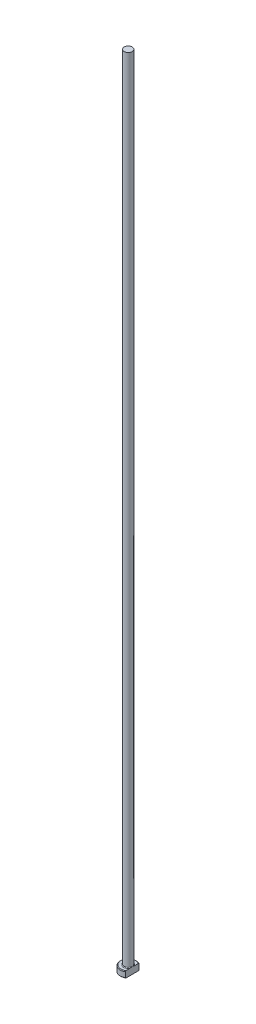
ISO-10303-21;
HEADER;
FILE_DESCRIPTION(('STEP AP214'),'2;1');
FILE_NAME('part.step','',(''),(''),'','','');
FILE_SCHEMA(('AUTOMOTIVE_DESIGN { 1 0 10303 214 1 1 1 1 }'));
ENDSEC;
DATA;
#1=APPLICATION_CONTEXT('core data for automotive mechanical design processes');
#2=APPLICATION_PROTOCOL_DEFINITION('international standard','automotive_design',2000,#1);
#3=PRODUCT_CONTEXT('',#1,'mechanical');
#4=PRODUCT('Part','Part','',(#3));
#5=PRODUCT_RELATED_PRODUCT_CATEGORY('part','',(#4));
#6=PRODUCT_DEFINITION_FORMATION('','',#4);
#7=PRODUCT_DEFINITION_CONTEXT('part definition',#1,'design');
#8=PRODUCT_DEFINITION('design','',#6,#7);
#9=PRODUCT_DEFINITION_SHAPE('','',#8);
#10=(LENGTH_UNIT() NAMED_UNIT(*) SI_UNIT(.MILLI.,.METRE.));
#11=(NAMED_UNIT(*) PLANE_ANGLE_UNIT() SI_UNIT($,.RADIAN.));
#12=(NAMED_UNIT(*) SI_UNIT($,.STERADIAN.) SOLID_ANGLE_UNIT());
#13=UNCERTAINTY_MEASURE_WITH_UNIT(LENGTH_MEASURE(1.E-05),#10,'distance_accuracy_value','');
#14=(GEOMETRIC_REPRESENTATION_CONTEXT(3) GLOBAL_UNCERTAINTY_ASSIGNED_CONTEXT((#13)) GLOBAL_UNIT_ASSIGNED_CONTEXT((#10,
#11,#12)) REPRESENTATION_CONTEXT('',''));
#15=CARTESIAN_POINT('',(0.,0.,0.));
#16=DIRECTION('',(0.,0.,1.));
#17=DIRECTION('',(1.,0.,0.));
#18=AXIS2_PLACEMENT_3D('',#15,#16,#17);
#19=CARTESIAN_POINT('',(0.,0.,0.));
#20=DIRECTION('',(0.,-1.,0.));
#21=DIRECTION('',(0.,0.,-1.));
#22=AXIS2_PLACEMENT_3D('',#19,#20,#21);
#23=PLANE('',#22);
#24=CARTESIAN_POINT('',(0.,0.,0.));
#25=DIRECTION('',(0.,-1.,0.));
#26=DIRECTION('',(0.,0.,-1.));
#27=AXIS2_PLACEMENT_3D('',#24,#25,#26);
#28=CIRCLE('',#27,2.3);
#29=CARTESIAN_POINT('',(1.24999999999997,0.,1.9306734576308));
#30=VERTEX_POINT('',#29);
#31=CARTESIAN_POINT('',(1.24999999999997,0.,-1.9306734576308));
#32=VERTEX_POINT('',#31);
#33=EDGE_CURVE('E98',#30,#32,#28,.T.);
#34=ORIENTED_EDGE('',*,*,#33,.T.);
#35=DIRECTION('',(0.,0.,1.));
#36=VECTOR('',#35,1.);
#37=CARTESIAN_POINT('',(1.24999999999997,0.,-2.16506350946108));
#38=LINE('',#37,#36);
#39=EDGE_CURVE('E83',#32,#30,#38,.T.);
#40=ORIENTED_EDGE('',*,*,#39,.T.);
#41=EDGE_LOOP('',(#34,#40));
#42=FACE_BOUND('',#41,.T.);
#43=ADVANCED_FACE('F32',(#42),#23,.T.);
#44=CARTESIAN_POINT('',(0.,259.958771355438,0.));
#45=DIRECTION('',(0.,1.,0.));
#46=DIRECTION('',(0.,0.,1.));
#47=AXIS2_PLACEMENT_3D('',#44,#45,#46);
#48=CYLINDRICAL_SURFACE('',#47,2.49999999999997);
#49=CARTESIAN_POINT('',(0.,1.79999999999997,0.));
#50=DIRECTION('',(0.,1.,0.));
#51=DIRECTION('',(0.,0.,1.));
#52=AXIS2_PLACEMENT_3D('',#49,#50,#51);
#53=CIRCLE('',#52,2.49999999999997);
#54=CARTESIAN_POINT('',(1.24999999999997,1.79999999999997,2.16506350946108));
#55=VERTEX_POINT('',#54);
#56=CARTESIAN_POINT('',(1.24999999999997,1.79999999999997,-2.16506350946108));
#57=VERTEX_POINT('',#56);
#58=EDGE_CURVE('E104',#55,#57,#53,.F.);
#59=ORIENTED_EDGE('',*,*,#58,.T.);
#60=DIRECTION('',(0.,-1.,0.));
#61=VECTOR('',#60,1.);
#62=CARTESIAN_POINT('',(1.24999999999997,250.,-2.16506350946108));
#63=LINE('',#62,#61);
#64=CARTESIAN_POINT('',(1.24999999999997,0.199999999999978,-2.16506350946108));
#65=VERTEX_POINT('',#64);
#66=EDGE_CURVE('E183',#57,#65,#63,.T.);
#67=ORIENTED_EDGE('',*,*,#66,.T.);
#68=CARTESIAN_POINT('',(0.,0.199999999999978,0.));
#69=DIRECTION('',(0.,-1.,0.));
#70=DIRECTION('',(0.,0.,-1.));
#71=AXIS2_PLACEMENT_3D('',#68,#69,#70);
#72=CIRCLE('',#71,2.49999999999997);
#73=CARTESIAN_POINT('',(1.24999999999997,0.199999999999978,2.16506350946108));
#74=VERTEX_POINT('',#73);
#75=EDGE_CURVE('E100',#65,#74,#72,.F.);
#76=ORIENTED_EDGE('',*,*,#75,.T.);
#77=DIRECTION('',(0.,-1.,0.));
#78=VECTOR('',#77,1.);
#79=CARTESIAN_POINT('',(1.24999999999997,250.,2.16506350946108));
#80=LINE('',#79,#78);
#81=EDGE_CURVE('E93',#55,#74,#80,.T.);
#82=ORIENTED_EDGE('',*,*,#81,.F.);
#83=EDGE_LOOP('',(#59,#67,#76,#82));
#84=FACE_BOUND('',#83,.T.);
#85=ADVANCED_FACE('F158',(#84),#48,.T.);
#86=CARTESIAN_POINT('',(-2.49999999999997,2.,0.));
#87=DIRECTION('',(0.,1.,0.));
#88=DIRECTION('',(0.,0.,1.));
#89=AXIS2_PLACEMENT_3D('',#86,#87,#88);
#90=PLANE('',#89);
#91=CARTESIAN_POINT('',(0.,2.,0.));
#92=DIRECTION('',(0.,1.,0.));
#93=DIRECTION('',(0.,0.,1.));
#94=AXIS2_PLACEMENT_3D('',#91,#92,#93);
#95=CIRCLE('',#94,2.29999999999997);
#96=CARTESIAN_POINT('',(1.24999999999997,2.,-1.93067345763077));
#97=VERTEX_POINT('',#96);
#98=CARTESIAN_POINT('',(1.24999999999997,2.,1.93067345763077));
#99=VERTEX_POINT('',#98);
#100=EDGE_CURVE('E178',#97,#99,#95,.T.);
#101=ORIENTED_EDGE('',*,*,#100,.T.);
#102=DIRECTION('',(0.,0.,-1.));
#103=VECTOR('',#102,1.);
#104=CARTESIAN_POINT('',(1.24999999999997,2.,0.));
#105=LINE('',#104,#103);
#106=CARTESIAN_POINT('',(1.24999999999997,1.99999999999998,0.73484692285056));
#107=VERTEX_POINT('',#106);
#108=EDGE_CURVE('E57',#99,#107,#105,.T.);
#109=ORIENTED_EDGE('',*,*,#108,.T.);
#110=CARTESIAN_POINT('',(0.,2.,0.));
#111=DIRECTION('',(0.,1.,0.));
#112=DIRECTION('',(0.,0.,1.));
#113=AXIS2_PLACEMENT_3D('',#110,#111,#112);
#114=CIRCLE('',#113,1.44999999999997);
#115=CARTESIAN_POINT('',(1.24999999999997,1.99999999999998,-0.734846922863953));
#116=VERTEX_POINT('',#115);
#117=EDGE_CURVE('E107',#107,#116,#114,.F.);
#118=ORIENTED_EDGE('',*,*,#117,.T.);
#119=EDGE_CURVE('E136',#116,#97,#105,.T.);
#120=ORIENTED_EDGE('',*,*,#119,.T.);
#121=EDGE_LOOP('',(#101,#109,#118,#120));
#122=FACE_BOUND('',#121,.T.);
#123=ADVANCED_FACE('F147',(#122),#90,.T.);
#124=CARTESIAN_POINT('',(0.,2.,0.));
#125=DIRECTION('',(0.,-1.,0.));
#126=DIRECTION('',(0.,0.,-1.));
#127=AXIS2_PLACEMENT_3D('',#124,#125,#126);
#128=CONICAL_SURFACE('',#127,2.29999999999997,0.785398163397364);
#129=ORIENTED_EDGE('',*,*,#58,.F.);
#130=CARTESIAN_POINT('',(1.24999999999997,-0.627301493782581,4.76610952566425));
#131=CARTESIAN_POINT('',(1.24999999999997,-0.522786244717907,4.65805337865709));
#132=CARTESIAN_POINT('',(1.24999999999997,-0.418383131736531,4.54988840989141));
#133=CARTESIAN_POINT('',(1.24999999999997,-0.209867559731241,4.33327605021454));
#134=CARTESIAN_POINT('',(1.24999999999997,-0.10575510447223,4.22482865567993));
#135=CARTESIAN_POINT('',(1.24999999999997,0.102163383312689,4.00753373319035));
#136=CARTESIAN_POINT('',(1.24999999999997,0.205969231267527,3.89868602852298));
#137=CARTESIAN_POINT('',(1.24999999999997,0.413121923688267,3.68055575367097));
#138=CARTESIAN_POINT('',(1.24999999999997,0.516468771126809,3.57127318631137));
#139=CARTESIAN_POINT('',(1.24999999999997,0.720522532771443,3.35432408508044));
#140=CARTESIAN_POINT('',(1.24999999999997,0.821241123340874,3.24666854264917));
#141=CARTESIAN_POINT('',(1.24999999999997,1.02192410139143,3.03065701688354));
#142=CARTESIAN_POINT('',(1.24999999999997,1.12188849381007,2.92230103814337));
#143=CARTESIAN_POINT('',(1.24999999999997,1.32077037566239,2.70467415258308));
#144=CARTESIAN_POINT('',(1.24999999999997,1.4196880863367,2.59540344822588));
#145=CARTESIAN_POINT('',(1.24999999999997,1.616082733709,2.37557697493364));
#146=CARTESIAN_POINT('',(1.24999999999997,1.71355972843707,2.26502125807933));
#147=CARTESIAN_POINT('',(1.24999999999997,1.86911393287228,2.08515617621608));
#148=CARTESIAN_POINT('',(1.24999999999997,1.9278559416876,2.01642247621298));
#149=CARTESIAN_POINT('',(1.24999999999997,2.04429378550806,1.87806056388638));
#150=CARTESIAN_POINT('',(1.24999999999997,2.10198951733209,1.80843226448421));
#151=CARTESIAN_POINT('',(1.24999999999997,2.21658041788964,1.66728976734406));
#152=CARTESIAN_POINT('',(1.24999999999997,2.27346067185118,1.59576341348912));
#153=CARTESIAN_POINT('',(1.24999999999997,2.38522965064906,1.45118948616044));
#154=CARTESIAN_POINT('',(1.24999999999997,2.44011885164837,1.37814228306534));
#155=CARTESIAN_POINT('',(1.24999999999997,2.54788773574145,1.22886697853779));
#156=CARTESIAN_POINT('',(1.24999999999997,2.6007242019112,1.15260740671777));
#157=CARTESIAN_POINT('',(1.24999999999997,2.70212030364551,0.997098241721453));
#158=CARTESIAN_POINT('',(1.24999999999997,2.75067405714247,0.917844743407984));
#159=CARTESIAN_POINT('',(1.24999999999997,2.84043729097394,0.756494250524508));
#160=CARTESIAN_POINT('',(1.24999999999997,2.88173033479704,0.674444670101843));
#161=CARTESIAN_POINT('',(1.24999999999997,2.95366083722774,0.505835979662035));
#162=CARTESIAN_POINT('',(1.24999999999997,2.98433405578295,0.41929315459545));
#163=CARTESIAN_POINT('',(1.24999999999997,3.017531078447,0.289507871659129));
#164=CARTESIAN_POINT('',(1.24999999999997,3.02633539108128,0.247870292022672));
#165=CARTESIAN_POINT('',(1.24999999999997,3.03997448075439,0.16393751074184));
#166=CARTESIAN_POINT('',(1.24999999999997,3.04480960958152,0.121642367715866));
#167=CARTESIAN_POINT('',(1.24999999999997,3.05016786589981,0.0369068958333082));
#168=CARTESIAN_POINT('',(1.24999999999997,3.05070431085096,-0.00553257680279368));
#169=CARTESIAN_POINT('',(1.24999999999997,3.04746162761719,-0.0902467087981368));
#170=CARTESIAN_POINT('',(1.24999999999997,3.0436821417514,-0.132521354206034));
#171=CARTESIAN_POINT('',(1.24999999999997,3.03212264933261,-0.216135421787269));
#172=CARTESIAN_POINT('',(1.24999999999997,3.0243775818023,-0.2574797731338));
#173=CARTESIAN_POINT('',(1.24999999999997,3.00536735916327,-0.339354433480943));
#174=CARTESIAN_POINT('',(1.24999999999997,2.9941008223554,-0.37988441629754));
#175=CARTESIAN_POINT('',(1.24999999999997,2.96852211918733,-0.460209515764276));
#176=CARTESIAN_POINT('',(1.24999999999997,2.95419322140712,-0.499999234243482));
#177=CARTESIAN_POINT('',(1.24999999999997,2.92306392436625,-0.578577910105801));
#178=CARTESIAN_POINT('',(1.24999999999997,2.90626403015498,-0.617367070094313));
#179=CARTESIAN_POINT('',(1.24999999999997,2.85269034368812,-0.732719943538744));
#180=CARTESIAN_POINT('',(1.24999999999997,2.81287978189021,-0.807869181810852));
#181=CARTESIAN_POINT('',(1.24999999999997,2.72799210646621,-0.9551579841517));
#182=CARTESIAN_POINT('',(1.24999999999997,2.68290855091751,-1.02729371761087));
#183=CARTESIAN_POINT('',(1.24999999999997,2.58903993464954,-1.16950551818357));
#184=CARTESIAN_POINT('',(1.24999999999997,2.54024093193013,-1.23957230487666));
#185=CARTESIAN_POINT('',(1.24999999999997,2.44021824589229,-1.37788366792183));
#186=CARTESIAN_POINT('',(1.24999999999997,2.38899576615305,-1.44612912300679));
#187=CARTESIAN_POINT('',(1.24999999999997,2.2841109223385,-1.5821527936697));
#188=CARTESIAN_POINT('',(1.24999999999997,2.23042529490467,-1.64991298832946));
#189=CARTESIAN_POINT('',(1.24999999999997,2.1217241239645,-1.78436052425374));
#190=CARTESIAN_POINT('',(1.24999999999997,2.06670849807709,-1.85104779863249));
#191=CARTESIAN_POINT('',(1.24999999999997,1.90044437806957,-2.04954410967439));
#192=CARTESIAN_POINT('',(1.24999999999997,1.78772044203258,-2.18011527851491));
#193=CARTESIAN_POINT('',(1.24999999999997,1.57927088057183,-2.41711311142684));
#194=CARTESIAN_POINT('',(1.24999999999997,1.48391557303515,-2.52386864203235));
#195=CARTESIAN_POINT('',(1.24999999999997,1.29202937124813,-2.73632311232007));
#196=CARTESIAN_POINT('',(1.24999999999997,1.19549844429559,-2.84202202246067));
#197=CARTESIAN_POINT('',(1.24999999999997,0.904469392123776,-3.15815976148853));
#198=CARTESIAN_POINT('',(1.24999999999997,0.708713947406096,-3.36743889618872));
#199=CARTESIAN_POINT('',(1.24999999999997,0.323382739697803,-3.7756119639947));
#200=CARTESIAN_POINT('',(1.24999999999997,0.133884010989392,-3.97457897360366));
#201=CARTESIAN_POINT('',(1.24999999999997,-0.151120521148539,-4.27209258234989));
#202=CARTESIAN_POINT('',(1.24999999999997,-0.246194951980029,-4.37105278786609));
#203=CARTESIAN_POINT('',(1.24999999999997,-0.436581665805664,-4.56874260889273));
#204=CARTESIAN_POINT('',(1.24999999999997,-0.53189394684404,-4.6674722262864));
#205=CARTESIAN_POINT('',(1.24999999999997,-0.627301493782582,-4.76610952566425));
#206=B_SPLINE_CURVE_WITH_KNOTS('',3,(#130,#131,#132,#133,#134,#135,#136,#137,#138,#139,#140,
#141,#142,#143,#144,#145,#146,#147,#148,#149,#150,#151,#152,#153,#154,#155,#156,#157,#158,#159,
#160,#161,#162,#163,#164,#165,#166,#167,#168,#169,#170,#171,#172,#173,#174,#175,#176,#177,#178,
#179,#180,#181,#182,#183,#184,#185,#186,#187,#188,#189,#190,#191,#192,#193,#194,#195,#196,#197,
#198,#199,#200,#201,#202,#203,#204,#205),.UNSPECIFIED.,.F.,.F.,(4,2,2,2,2,2,2,2,2,2,2,2,2,2,2,2,
2,2,2,2,2,2,2,2,2,2,2,2,2,2,2,2,2,2,2,2,2,4),(0.,0.450994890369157,0.901995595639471,
1.35322763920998,1.80445675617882,2.24672733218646,2.68899501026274,3.1311672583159,
3.57332164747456,3.84456018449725,4.11582532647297,4.38995864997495,4.66402597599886,
4.94225842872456,5.2208672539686,5.4960231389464,5.77024327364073,5.89775644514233,
6.02525831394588,6.15236502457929,6.27948226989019,6.40549833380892,6.53156390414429,
6.65833670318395,6.78508362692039,7.03983854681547,7.29490801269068,7.55098686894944,
7.80693985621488,8.06626716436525,8.32561057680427,8.84304654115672,9.27246240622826,
9.70189024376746,10.5615524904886,11.3858525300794,11.7975442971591,12.2092326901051),.UNSPECIFIED.);
#207=EDGE_CURVE('E135',#55,#99,#206,.T.);
#208=ORIENTED_EDGE('',*,*,#207,.T.);
#209=ORIENTED_EDGE('',*,*,#100,.F.);
#210=EDGE_CURVE('E127',#97,#57,#206,.T.);
#211=ORIENTED_EDGE('',*,*,#210,.T.);
#212=EDGE_LOOP('',(#129,#208,#209,#211));
#213=FACE_BOUND('',#212,.T.);
#214=ADVANCED_FACE('F143',(#213),#128,.T.);
#215=CARTESIAN_POINT('',(0.,0.199999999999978,0.));
#216=DIRECTION('',(0.,1.,0.));
#217=DIRECTION('',(0.,0.,1.));
#218=AXIS2_PLACEMENT_3D('',#215,#216,#217);
#219=CONICAL_SURFACE('',#218,2.49999999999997,0.785398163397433);
#220=ORIENTED_EDGE('',*,*,#75,.F.);
#221=CARTESIAN_POINT('',(1.24999999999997,2.62730149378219,-4.76610952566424));
#222=CARTESIAN_POINT('',(1.24999999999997,2.52278624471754,-4.6580533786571));
#223=CARTESIAN_POINT('',(1.24999999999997,2.41838313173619,-4.54988840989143));
#224=CARTESIAN_POINT('',(1.24999999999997,2.20986755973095,-4.33327605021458));
#225=CARTESIAN_POINT('',(1.24999999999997,2.10575510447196,-4.22482865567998));
#226=CARTESIAN_POINT('',(1.24999999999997,1.89783661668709,-4.00753373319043));
#227=CARTESIAN_POINT('',(1.24999999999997,1.79403076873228,-3.89868602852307));
#228=CARTESIAN_POINT('',(1.24999999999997,1.58687807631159,-3.68055575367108));
#229=CARTESIAN_POINT('',(1.24999999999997,1.48353122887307,-3.57127318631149));
#230=CARTESIAN_POINT('',(1.24999999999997,1.27947746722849,-3.35432408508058));
#231=CARTESIAN_POINT('',(1.24999999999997,1.17875887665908,-3.24666854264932));
#232=CARTESIAN_POINT('',(1.24999999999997,0.978075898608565,-3.03065701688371));
#233=CARTESIAN_POINT('',(1.24999999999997,0.87811150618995,-2.92230103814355));
#234=CARTESIAN_POINT('',(1.24999999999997,0.679229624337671,-2.70467415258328));
#235=CARTESIAN_POINT('',(1.24999999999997,0.580311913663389,-2.59540344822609));
#236=CARTESIAN_POINT('',(1.24999999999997,0.383917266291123,-2.37557697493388));
#237=CARTESIAN_POINT('',(1.24999999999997,0.286440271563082,-2.26502125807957));
#238=CARTESIAN_POINT('',(1.24999999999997,0.130886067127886,-2.08515617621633));
#239=CARTESIAN_POINT('',(1.24999999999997,0.0721440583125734,-2.01642247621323));
#240=CARTESIAN_POINT('',(1.24999999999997,-0.0442937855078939,-1.87806056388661));
#241=CARTESIAN_POINT('',(1.24999999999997,-0.101989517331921,-1.80843226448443));
#242=CARTESIAN_POINT('',(1.24999999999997,-0.216580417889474,-1.66728976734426));
#243=CARTESIAN_POINT('',(1.24999999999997,-0.273460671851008,-1.59576341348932));
#244=CARTESIAN_POINT('',(1.24999999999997,-0.38522965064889,-1.45118948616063));
#245=CARTESIAN_POINT('',(1.24999999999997,-0.440118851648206,-1.37814228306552));
#246=CARTESIAN_POINT('',(1.24999999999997,-0.547887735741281,-1.22886697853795));
#247=CARTESIAN_POINT('',(1.24999999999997,-0.600724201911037,-1.15260740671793));
#248=CARTESIAN_POINT('',(1.24999999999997,-0.702120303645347,-0.997098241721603));
#249=CARTESIAN_POINT('',(1.24999999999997,-0.750674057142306,-0.917844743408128));
#250=CARTESIAN_POINT('',(1.24999999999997,-0.840437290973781,-0.756494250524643));
#251=CARTESIAN_POINT('',(1.24999999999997,-0.881730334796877,-0.674444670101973));
#252=CARTESIAN_POINT('',(1.24999999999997,-0.953660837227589,-0.505835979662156));
#253=CARTESIAN_POINT('',(1.24999999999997,-0.984334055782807,-0.419293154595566));
#254=CARTESIAN_POINT('',(1.24999999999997,-1.01753107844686,-0.289507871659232));
#255=CARTESIAN_POINT('',(1.24999999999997,-1.02633539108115,-0.247870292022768));
#256=CARTESIAN_POINT('',(1.24999999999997,-1.03997448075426,-0.163937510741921));
#257=CARTESIAN_POINT('',(1.24999999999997,-1.04480960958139,-0.121642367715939));
#258=CARTESIAN_POINT('',(1.24999999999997,-1.05016786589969,-0.0369068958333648));
#259=CARTESIAN_POINT('',(1.24999999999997,-1.05070431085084,0.0055325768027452));
#260=CARTESIAN_POINT('',(1.24999999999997,-1.04746162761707,0.0902467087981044));
#261=CARTESIAN_POINT('',(1.24999999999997,-1.04368214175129,0.132521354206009));
#262=CARTESIAN_POINT('',(1.24999999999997,-1.03212264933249,0.21613542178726));
#263=CARTESIAN_POINT('',(1.24999999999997,-1.02437758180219,0.2574797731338));
#264=CARTESIAN_POINT('',(1.24999999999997,-1.00536735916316,0.339354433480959));
#265=CARTESIAN_POINT('',(1.24999999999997,-0.994100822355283,0.379884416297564));
#266=CARTESIAN_POINT('',(1.24999999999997,-0.968522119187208,0.460209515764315));
#267=CARTESIAN_POINT('',(1.24999999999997,-0.954193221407,0.499999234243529));
#268=CARTESIAN_POINT('',(1.24999999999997,-0.923063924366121,0.578577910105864));
#269=CARTESIAN_POINT('',(1.24999999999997,-0.906264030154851,0.617367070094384));
#270=CARTESIAN_POINT('',(1.24999999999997,-0.852690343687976,0.732719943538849));
#271=CARTESIAN_POINT('',(1.24999999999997,-0.812879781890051,0.807869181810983));
#272=CARTESIAN_POINT('',(1.24999999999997,-0.727992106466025,0.955157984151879));
#273=CARTESIAN_POINT('',(1.24999999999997,-0.682908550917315,1.02729371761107));
#274=CARTESIAN_POINT('',(1.24999999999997,-0.589039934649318,1.16950551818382));
#275=CARTESIAN_POINT('',(1.24999999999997,-0.540240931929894,1.23957230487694));
#276=CARTESIAN_POINT('',(1.24999999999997,-0.440218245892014,1.37788366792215));
#277=CARTESIAN_POINT('',(1.24999999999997,-0.388995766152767,1.44612912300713));
#278=CARTESIAN_POINT('',(1.24999999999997,-0.284110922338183,1.58215279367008));
#279=CARTESIAN_POINT('',(1.24999999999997,-0.230425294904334,1.64991298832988));
#280=CARTESIAN_POINT('',(1.24999999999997,-0.121724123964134,1.7843605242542));
#281=CARTESIAN_POINT('',(1.24999999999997,-0.0667084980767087,1.85104779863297));
#282=CARTESIAN_POINT('',(1.24999999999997,0.0995556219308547,2.04954410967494));
#283=CARTESIAN_POINT('',(1.24999999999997,0.212279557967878,2.1801152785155));
#284=CARTESIAN_POINT('',(1.24999999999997,0.420729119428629,2.41711311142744));
#285=CARTESIAN_POINT('',(1.24999999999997,0.516084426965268,2.52386864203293));
#286=CARTESIAN_POINT('',(1.24999999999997,0.707970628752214,2.73632311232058));
#287=CARTESIAN_POINT('',(1.24999999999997,0.804501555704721,2.84202202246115));
#288=CARTESIAN_POINT('',(1.24999999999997,1.09553060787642,3.15815976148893));
#289=CARTESIAN_POINT('',(1.24999999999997,1.29128605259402,3.36743889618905));
#290=CARTESIAN_POINT('',(1.24999999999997,1.67661726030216,3.77561196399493));
#291=CARTESIAN_POINT('',(1.24999999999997,1.8661159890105,3.97457897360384));
#292=CARTESIAN_POINT('',(1.24999999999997,2.15112052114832,4.27209258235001));
#293=CARTESIAN_POINT('',(1.24999999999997,2.24619495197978,4.37105278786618));
#294=CARTESIAN_POINT('',(1.24999999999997,2.43658166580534,4.56874260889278));
#295=CARTESIAN_POINT('',(1.24999999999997,2.53189394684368,4.66747222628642));
#296=CARTESIAN_POINT('',(1.24999999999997,2.62730149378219,4.76610952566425));
#297=B_SPLINE_CURVE_WITH_KNOTS('',3,(#221,#222,#223,#224,#225,#226,#227,#228,#229,#230,#231,
#232,#233,#234,#235,#236,#237,#238,#239,#240,#241,#242,#243,#244,#245,#246,#247,#248,#249,#250,
#251,#252,#253,#254,#255,#256,#257,#258,#259,#260,#261,#262,#263,#264,#265,#266,#267,#268,#269,
#270,#271,#272,#273,#274,#275,#276,#277,#278,#279,#280,#281,#282,#283,#284,#285,#286,#287,#288,
#289,#290,#291,#292,#293,#294,#295,#296),.UNSPECIFIED.,.F.,.F.,(4,2,2,2,2,2,2,2,2,2,2,2,2,2,2,2,
2,2,2,2,2,2,2,2,2,2,2,2,2,2,2,2,2,2,2,2,2,4),(0.,0.450994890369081,0.901995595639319,
1.35322763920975,1.80445675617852,2.24672733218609,2.6889950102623,3.1311672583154,
3.57332164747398,3.84456018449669,4.11582532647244,4.38995864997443,4.66402597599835,
4.94225842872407,5.22086725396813,5.49602313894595,5.77024327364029,5.89775644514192,
6.02525831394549,6.15236502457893,6.27948226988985,6.4054983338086,6.531563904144,
6.65833670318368,6.78508362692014,7.03983854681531,7.2949080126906,7.55098686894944,
7.80693985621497,8.06626716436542,8.32561057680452,8.84304654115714,9.27246240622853,
9.70189024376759,10.5615524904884,11.385852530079,11.7975442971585,12.2092326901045),.UNSPECIFIED.);
#298=EDGE_CURVE('E86',#65,#32,#297,.T.);
#299=ORIENTED_EDGE('',*,*,#298,.T.);
#300=ORIENTED_EDGE('',*,*,#33,.F.);
#301=EDGE_CURVE('E89',#30,#74,#297,.T.);
#302=ORIENTED_EDGE('',*,*,#301,.T.);
#303=EDGE_LOOP('',(#220,#299,#300,#302));
#304=FACE_BOUND('',#303,.T.);
#305=ADVANCED_FACE('F97',(#304),#219,.T.);
#306=CARTESIAN_POINT('',(0.,2.19999999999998,0.));
#307=DIRECTION('',(0.,1.,0.));
#308=DIRECTION('',(0.,0.,1.));
#309=AXIS2_PLACEMENT_3D('',#306,#307,#308);
#310=TOROIDAL_SURFACE('',#309,1.44999999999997,0.2);
#311=CARTESIAN_POINT('',(1.24999999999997,2.19999999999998,0.));
#312=CARTESIAN_POINT('',(1.24999999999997,2.20000051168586,-1.9767961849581E-10));
#313=CARTESIAN_POINT('',(1.24999999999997,2.20000102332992,-1.08908063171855E-07));
#314=CARTESIAN_POINT('',(1.24999999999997,2.20000200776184,-4.52594759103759E-07));
#315=CARTESIAN_POINT('',(1.24999999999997,2.20000247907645,-6.90993033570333E-07));
#316=CARTESIAN_POINT('',(1.24999999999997,2.20000341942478,-1.26357942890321E-06));
#317=CARTESIAN_POINT('',(1.24999999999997,2.20000388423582,-1.60457617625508E-06));
#318=CARTESIAN_POINT('',(1.24999999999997,2.20000476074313,-2.3395489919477E-06));
#319=CARTESIAN_POINT('',(1.24999999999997,2.20000517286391,-2.7330414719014E-06));
#320=CARTESIAN_POINT('',(1.24999999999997,2.20000655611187,-4.14544010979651E-06));
#321=CARTESIAN_POINT('',(1.24999999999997,2.20000745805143,-5.23310089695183E-06));
#322=CARTESIAN_POINT('',(1.24999999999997,2.20000906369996,-7.47950358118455E-06));
#323=CARTESIAN_POINT('',(1.24999999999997,2.20000977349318,-8.63414435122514E-06));
#324=CARTESIAN_POINT('',(1.24999999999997,2.20001244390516,-1.31453476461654E-05));
#325=CARTESIAN_POINT('',(1.24999999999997,2.20001426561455,-1.65880555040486E-05));
#326=CARTESIAN_POINT('',(1.24999999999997,2.20001724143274,-2.33729028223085E-05));
#327=CARTESIAN_POINT('',(1.24999999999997,2.20001844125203,-2.66956153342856E-05));
#328=CARTESIAN_POINT('',(1.24999999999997,2.2000235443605,-4.08635084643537E-05));
#329=CARTESIAN_POINT('',(1.24999999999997,2.20002741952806,-5.17114612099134E-05));
#330=CARTESIAN_POINT('',(1.24999999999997,2.20003363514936,-7.20057670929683E-05));
#331=CARTESIAN_POINT('',(1.24999999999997,2.20003612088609,-8.14057063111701E-05));
#332=CARTESIAN_POINT('',(1.24999999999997,2.20005581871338,-0.000149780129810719));
#333=CARTESIAN_POINT('',(1.24999999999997,2.20008094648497,-0.000206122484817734));
#334=CARTESIAN_POINT('',(1.24999999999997,2.20017507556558,-0.000425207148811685));
#335=CARTESIAN_POINT('',(1.24999999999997,2.20023819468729,-0.000589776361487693));
#336=CARTESIAN_POINT('',(1.24999999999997,2.20048692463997,-0.00122878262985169));
#337=CARTESIAN_POINT('',(1.24999999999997,2.20067870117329,-0.00170134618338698));
#338=CARTESIAN_POINT('',(1.24999999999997,2.20146022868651,-0.00363636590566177));
#339=CARTESIAN_POINT('',(1.24999999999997,2.20204298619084,-0.00510090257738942));
#340=CARTESIAN_POINT('',(1.24999999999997,2.20939719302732,-0.0235712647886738));
#341=CARTESIAN_POINT('',(1.24999999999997,2.21621259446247,-0.0405643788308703));
#342=CARTESIAN_POINT('',(1.24999999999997,2.22951000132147,-0.0739606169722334));
#343=CARTESIAN_POINT('',(1.24999999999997,2.23599508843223,-0.0903626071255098));
#344=CARTESIAN_POINT('',(1.24999999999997,2.24961430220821,-0.12511129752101));
#345=CARTESIAN_POINT('',(1.24999999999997,2.25673641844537,-0.143462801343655));
#346=CARTESIAN_POINT('',(1.24999999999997,2.27085039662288,-0.180427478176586));
#347=CARTESIAN_POINT('',(1.24999999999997,2.27784022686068,-0.199041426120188));
#348=CARTESIAN_POINT('',(1.24999999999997,2.29479134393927,-0.245221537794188));
#349=CARTESIAN_POINT('',(1.24999999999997,2.30459026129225,-0.272848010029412));
#350=CARTESIAN_POINT('',(1.24999999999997,2.32310234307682,-0.327738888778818));
#351=CARTESIAN_POINT('',(1.24999999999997,2.33183568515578,-0.354996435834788));
#352=CARTESIAN_POINT('',(1.24999999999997,2.3493656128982,-0.41374417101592));
#353=CARTESIAN_POINT('',(1.24999999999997,2.35799470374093,-0.445285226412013));
#354=CARTESIAN_POINT('',(1.24999999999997,2.37338463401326,-0.509091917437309));
#355=CARTESIAN_POINT('',(1.24999999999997,2.38013036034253,-0.541361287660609));
#356=CARTESIAN_POINT('',(1.24999999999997,2.39136059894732,-0.608339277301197));
#357=CARTESIAN_POINT('',(1.24999999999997,2.39568167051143,-0.643076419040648));
#358=CARTESIAN_POINT('',(1.24999999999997,2.40037605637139,-0.712733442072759));
#359=CARTESIAN_POINT('',(1.24999999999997,2.40076553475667,-0.747651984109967));
#360=CARTESIAN_POINT('',(1.24999999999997,2.39677668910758,-0.8081037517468));
#361=CARTESIAN_POINT('',(1.24999999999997,2.39361441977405,-0.833711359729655));
#362=CARTESIAN_POINT('',(1.24999999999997,2.38355990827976,-0.883915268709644));
#363=CARTESIAN_POINT('',(1.24999999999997,2.37671813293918,-0.908520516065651));
#364=CARTESIAN_POINT('',(1.24999999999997,2.36252570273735,-0.944879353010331));
#365=CARTESIAN_POINT('',(1.24999999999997,2.35688428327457,-0.957298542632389));
#366=CARTESIAN_POINT('',(1.24999999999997,2.34399066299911,-0.981318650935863));
#367=CARTESIAN_POINT('',(1.24999999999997,2.33673636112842,-0.992918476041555));
#368=CARTESIAN_POINT('',(1.24999999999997,2.32199744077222,-1.01267533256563));
#369=CARTESIAN_POINT('',(1.24999999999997,2.31482723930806,-1.02106482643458));
#370=CARTESIAN_POINT('',(1.24999999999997,2.29924321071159,-1.03659690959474));
#371=CARTESIAN_POINT('',(1.24999999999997,2.29083198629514,-1.04374204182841));
#372=CARTESIAN_POINT('',(1.24999999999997,2.27498600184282,-1.05478694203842));
#373=CARTESIAN_POINT('',(1.24999999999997,2.26780814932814,-1.05905359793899));
#374=CARTESIAN_POINT('',(1.24999999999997,2.25284782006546,-1.06635953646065));
#375=CARTESIAN_POINT('',(1.24999999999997,2.24506572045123,-1.06939957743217));
#376=CARTESIAN_POINT('',(1.24999999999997,2.22901828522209,-1.07404931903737));
#377=CARTESIAN_POINT('',(1.24999999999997,2.22074990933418,-1.07564870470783));
#378=CARTESIAN_POINT('',(1.24999999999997,2.20405985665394,-1.07723717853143));
#379=CARTESIAN_POINT('',(1.24999999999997,2.19563825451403,-1.07722703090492));
#380=CARTESIAN_POINT('',(1.24999999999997,2.17988128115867,-1.07569157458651));
#381=CARTESIAN_POINT('',(1.24999999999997,2.17252879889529,-1.0743339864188));
#382=CARTESIAN_POINT('',(1.24999999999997,2.15814333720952,-1.07044616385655));
#383=CARTESIAN_POINT('',(1.24999999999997,2.15111040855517,-1.06791574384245));
#384=CARTESIAN_POINT('',(1.24999999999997,2.13724955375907,-1.06171920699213));
#385=CARTESIAN_POINT('',(1.24999999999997,2.13043935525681,-1.05801386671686));
#386=CARTESIAN_POINT('',(1.24999999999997,2.11740316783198,-1.04969609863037));
#387=CARTESIAN_POINT('',(1.24999999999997,2.11117742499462,-1.04508329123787));
#388=CARTESIAN_POINT('',(1.24999999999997,2.09586196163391,-1.03220341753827));
#389=CARTESIAN_POINT('',(1.24999999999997,2.08723799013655,-1.02338140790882));
#390=CARTESIAN_POINT('',(1.24999999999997,2.07148817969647,-1.00448021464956));
#391=CARTESIAN_POINT('',(1.24999999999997,2.0643671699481,-0.994397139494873));
#392=CARTESIAN_POINT('',(1.24999999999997,2.04800089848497,-0.967694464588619));
#393=CARTESIAN_POINT('',(1.24999999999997,2.0397014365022,-0.950498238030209));
#394=CARTESIAN_POINT('',(1.24999999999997,2.02582422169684,-0.915117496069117));
#395=CARTESIAN_POINT('',(1.24999999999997,2.02024415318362,-0.896933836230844));
#396=CARTESIAN_POINT('',(1.24999999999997,2.00805724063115,-0.846781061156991));
#397=CARTESIAN_POINT('',(1.24999999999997,2.00359525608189,-0.8142976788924));
#398=CARTESIAN_POINT('',(1.24999999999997,1.99933348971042,-0.748574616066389));
#399=CARTESIAN_POINT('',(1.24999999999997,1.99961552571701,-0.715331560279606));
#400=CARTESIAN_POINT('',(1.24999999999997,2.00446632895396,-0.637920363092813));
#401=CARTESIAN_POINT('',(1.24999999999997,2.01044886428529,-0.593849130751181));
#402=CARTESIAN_POINT('',(1.24999999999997,2.02681929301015,-0.506401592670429));
#403=CARTESIAN_POINT('',(1.24999999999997,2.03722697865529,-0.463029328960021));
#404=CARTESIAN_POINT('',(1.24999999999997,2.06007158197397,-0.380638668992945));
#405=CARTESIAN_POINT('',(1.24999999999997,2.07227412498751,-0.34155342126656));
#406=CARTESIAN_POINT('',(1.24999999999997,2.09824323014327,-0.264347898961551));
#407=CARTESIAN_POINT('',(1.24999999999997,2.11199311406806,-0.226221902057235));
#408=CARTESIAN_POINT('',(1.24999999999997,2.13108825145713,-0.175350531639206));
#409=CARTESIAN_POINT('',(1.24999999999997,2.13599999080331,-0.16243890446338));
#410=CARTESIAN_POINT('',(1.24999999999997,2.14604281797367,-0.13631825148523));
#411=CARTESIAN_POINT('',(1.24999999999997,2.15117629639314,-0.123110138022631));
#412=CARTESIAN_POINT('',(1.24999999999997,2.16341702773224,-0.0918425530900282));
#413=CARTESIAN_POINT('',(1.24999999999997,2.17055250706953,-0.0737943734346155));
#414=CARTESIAN_POINT('',(1.24999999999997,2.18426943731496,-0.0393586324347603));
#415=CARTESIAN_POINT('',(1.24999999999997,2.19084281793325,-0.0229681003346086));
#416=CARTESIAN_POINT('',(1.24999999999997,2.19795564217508,-0.00510438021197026));
#417=CARTESIAN_POINT('',(1.24999999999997,2.19853702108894,-0.00364331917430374));
#418=CARTESIAN_POINT('',(1.24999999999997,2.19931818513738,-0.00170914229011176));
#419=CARTESIAN_POINT('',(1.24999999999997,2.19951102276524,-0.00123396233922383));
#420=CARTESIAN_POINT('',(1.24999999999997,2.19976104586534,-0.000591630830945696));
#421=CARTESIAN_POINT('',(1.24999999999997,2.19982443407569,-0.000426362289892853));
#422=CARTESIAN_POINT('',(1.24999999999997,2.1999189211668,-0.000206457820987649));
#423=CARTESIAN_POINT('',(1.24999999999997,2.19994410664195,-0.000149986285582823));
#424=CARTESIAN_POINT('',(1.24999999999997,2.19996383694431,-8.1464748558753E-05));
#425=CARTESIAN_POINT('',(1.24999999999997,2.19996632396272,-7.20551566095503E-05));
#426=CARTESIAN_POINT('',(1.24999999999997,2.19997254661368,-5.17396175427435E-05));
#427=CARTESIAN_POINT('',(1.24999999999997,2.19997642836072,-4.08803462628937E-05));
#428=CARTESIAN_POINT('',(1.24999999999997,2.19998153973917,-2.66997572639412E-05));
#429=CARTESIAN_POINT('',(1.24999999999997,2.1999827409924,-2.33755457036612E-05));
#430=CARTESIAN_POINT('',(1.24999999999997,2.19998572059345,-1.65878757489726E-05));
#431=CARTESIAN_POINT('',(1.24999999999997,2.19998754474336,-1.31438993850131E-05));
#432=CARTESIAN_POINT('',(1.24999999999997,2.19999021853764,-8.63150510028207E-06));
#433=CARTESIAN_POINT('',(1.24999999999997,2.19999092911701,-7.47674879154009E-06));
#434=CARTESIAN_POINT('',(1.24999999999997,2.19999253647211,-5.23027079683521E-06));
#435=CARTESIAN_POINT('',(1.24999999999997,2.19999343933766,-4.14265820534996E-06));
#436=CARTESIAN_POINT('',(1.24999999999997,2.19999482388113,-2.73051190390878E-06));
#437=CARTESIAN_POINT('',(1.24999999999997,2.19999523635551,-2.33712918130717E-06));
#438=CARTESIAN_POINT('',(1.24999999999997,2.19999611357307,-1.60243917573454E-06));
#439=CARTESIAN_POINT('',(1.24999999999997,2.19999657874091,-1.26161620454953E-06));
#440=CARTESIAN_POINT('',(1.24999999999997,2.19999751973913,-6.89449591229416E-07));
#441=CARTESIAN_POINT('',(1.24999999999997,2.19999799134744,-4.51288697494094E-07));
#442=CARTESIAN_POINT('',(1.24999999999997,2.19999897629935,-1.08178109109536E-07));
#443=CARTESIAN_POINT('',(1.24999999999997,2.19999948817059,1.97735059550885E-10));
#444=CARTESIAN_POINT('',(1.24999999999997,2.19999999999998,0.));
#445=B_SPLINE_CURVE_WITH_KNOTS('',3,(#311,#312,#313,#314,#315,#316,#317,#318,#319,#320,#321,
#322,#323,#324,#325,#326,#327,#328,#329,#330,#331,#332,#333,#334,#335,#336,#337,#338,#339,#340,
#341,#342,#343,#344,#345,#346,#347,#348,#349,#350,#351,#352,#353,#354,#355,#356,#357,#358,#359,
#360,#361,#362,#363,#364,#365,#366,#367,#368,#369,#370,#371,#372,#373,#374,#375,#376,#377,#378,
#379,#380,#381,#382,#383,#384,#385,#386,#387,#388,#389,#390,#391,#392,#393,#394,#395,#396,#397,
#398,#399,#400,#401,#402,#403,#404,#405,#406,#407,#408,#409,#410,#411,#412,#413,#414,#415,#416,
#417,#418,#419,#420,#421,#422,#423,#424,#425,#426,#427,#428,#429,#430,#431,#432,#433,#434,#435,
#436,#437,#438,#439,#440,#441,#442,#443,#444),.UNSPECIFIED.,.T.,.F.,(4,2,2,2,2,2,2,2,2,2,2,2,2,
2,2,2,2,2,2,2,2,2,2,2,2,2,2,2,2,2,2,2,2,2,2,2,2,2,2,2,2,2,2,2,2,2,2,2,2,2,2,2,2,2,2,2,2,2,2,2,2,
2,2,2,2,2,4),(0.,1.53427576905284E-06,3.11115061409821E-06,4.83351643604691E-06,
6.54098955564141E-06,1.07594295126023E-05,1.48222852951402E-05,2.64707315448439E-05,
3.70576290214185E-05,7.16088727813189E-05,0.000100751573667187,0.000285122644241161,
0.000814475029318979,0.00234373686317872,0.00707317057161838,0.061994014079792,
0.114907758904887,0.173961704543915,0.233609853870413,0.321537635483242,0.407388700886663,
0.505443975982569,0.604264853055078,0.709126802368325,0.813557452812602,0.890773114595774,
0.966955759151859,1.00778845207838,1.04867465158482,1.08167318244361,1.1146034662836,
1.13955805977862,1.16449720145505,1.18961351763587,1.21471790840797,1.23704542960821,
1.25937648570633,1.28254952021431,1.30573226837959,1.34253218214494,1.37944859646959,
1.43640829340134,1.4933194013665,1.59113685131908,1.69064301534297,1.82371118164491,
1.9573808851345,2.08016146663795,2.20172662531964,2.24316968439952,2.28568093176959,
2.34390494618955,2.39687801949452,2.40159623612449,2.40313396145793,2.40366556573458,
2.40385035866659,2.40387953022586,2.40391411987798,2.40392471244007,2.40393636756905,
2.4039404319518,2.40394465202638,2.40394636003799,2.4039480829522,2.40394966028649,
2.40395119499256),.UNSPECIFIED.);
#446=CARTESIAN_POINT('',(1.24999999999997,2.19999999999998,0.));
#447=VERTEX_POINT('',#446);
#448=EDGE_CURVE('E11',#116,#447,#445,.T.);
#449=ORIENTED_EDGE('',*,*,#448,.F.);
#450=ORIENTED_EDGE('',*,*,#117,.F.);
#451=CARTESIAN_POINT('',(1.24999999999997,2.19999999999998,0.));
#452=CARTESIAN_POINT('',(1.24999999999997,2.1999994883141,1.97679627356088E-10));
#453=CARTESIAN_POINT('',(1.24999999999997,2.19999897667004,1.08908063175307E-07));
#454=CARTESIAN_POINT('',(1.24999999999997,2.19999799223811,4.52594759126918E-07));
#455=CARTESIAN_POINT('',(1.24999999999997,2.19999752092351,6.90993033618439E-07));
#456=CARTESIAN_POINT('',(1.24999999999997,2.19999658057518,1.26357942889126E-06));
#457=CARTESIAN_POINT('',(1.24999999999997,2.19999611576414,1.60457617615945E-06));
#458=CARTESIAN_POINT('',(1.24999999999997,2.19999523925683,2.33954899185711E-06));
#459=CARTESIAN_POINT('',(1.24999999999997,2.19999482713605,2.73304147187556E-06));
#460=CARTESIAN_POINT('',(1.24999999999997,2.19999344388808,4.14544010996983E-06));
#461=CARTESIAN_POINT('',(1.24999999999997,2.19999254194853,5.23310089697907E-06));
#462=CARTESIAN_POINT('',(1.24999999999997,2.1999909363,7.47950358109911E-06));
#463=CARTESIAN_POINT('',(1.24999999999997,2.19999022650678,8.63414435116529E-06));
#464=CARTESIAN_POINT('',(1.24999999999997,2.1999875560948,1.3145347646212E-05));
#465=CARTESIAN_POINT('',(1.24999999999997,2.19998573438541,1.65880555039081E-05));
#466=CARTESIAN_POINT('',(1.24999999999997,2.19998275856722,2.33729028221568E-05));
#467=CARTESIAN_POINT('',(1.24999999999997,2.19998155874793,2.66956153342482E-05));
#468=CARTESIAN_POINT('',(1.24999999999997,2.19997645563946,4.08635084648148E-05));
#469=CARTESIAN_POINT('',(1.24999999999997,2.1999725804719,5.1711461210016E-05));
#470=CARTESIAN_POINT('',(1.24999999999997,2.1999663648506,7.2005767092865E-05));
#471=CARTESIAN_POINT('',(1.24999999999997,2.19996387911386,8.14057063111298E-05));
#472=CARTESIAN_POINT('',(1.24999999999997,2.19994418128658,0.000149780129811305));
#473=CARTESIAN_POINT('',(1.24999999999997,2.19991905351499,0.000206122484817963));
#474=CARTESIAN_POINT('',(1.24999999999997,2.19982492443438,0.000425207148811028));
#475=CARTESIAN_POINT('',(1.24999999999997,2.19976180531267,0.000589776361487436));
#476=CARTESIAN_POINT('',(1.24999999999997,2.19951307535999,0.00122878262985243));
#477=CARTESIAN_POINT('',(1.24999999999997,2.19932129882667,0.00170134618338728));
#478=CARTESIAN_POINT('',(1.24999999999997,2.19853977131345,0.00363636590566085));
#479=CARTESIAN_POINT('',(1.24999999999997,2.19795701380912,0.00510090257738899));
#480=CARTESIAN_POINT('',(1.24999999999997,2.19060280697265,0.0235712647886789));
#481=CARTESIAN_POINT('',(1.24999999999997,2.18378740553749,0.0405643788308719));
#482=CARTESIAN_POINT('',(1.24999999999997,2.17048999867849,0.0739606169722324));
#483=CARTESIAN_POINT('',(1.24999999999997,2.16400491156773,0.0903626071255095));
#484=CARTESIAN_POINT('',(1.24999999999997,2.15038569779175,0.125111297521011));
#485=CARTESIAN_POINT('',(1.24999999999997,2.14326358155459,0.143462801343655));
#486=CARTESIAN_POINT('',(1.24999999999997,2.12914960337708,0.180427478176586));
#487=CARTESIAN_POINT('',(1.24999999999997,2.12215977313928,0.199041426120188));
#488=CARTESIAN_POINT('',(1.24999999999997,2.10520865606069,0.245221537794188));
#489=CARTESIAN_POINT('',(1.24999999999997,2.09540973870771,0.272848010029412));
#490=CARTESIAN_POINT('',(1.24999999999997,2.07689765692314,0.327738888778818));
#491=CARTESIAN_POINT('',(1.24999999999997,2.06816431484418,0.354996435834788));
#492=CARTESIAN_POINT('',(1.24999999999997,2.05063438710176,0.41374417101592));
#493=CARTESIAN_POINT('',(1.24999999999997,2.04200529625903,0.445285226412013));
#494=CARTESIAN_POINT('',(1.24999999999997,2.0266153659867,0.509091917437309));
#495=CARTESIAN_POINT('',(1.24999999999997,2.01986963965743,0.541361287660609));
#496=CARTESIAN_POINT('',(1.24999999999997,2.00863940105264,0.608339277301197));
#497=CARTESIAN_POINT('',(1.24999999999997,2.00431832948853,0.643076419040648));
#498=CARTESIAN_POINT('',(1.24999999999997,1.99962394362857,0.712733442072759));
#499=CARTESIAN_POINT('',(1.24999999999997,1.99923446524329,0.747651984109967));
#500=CARTESIAN_POINT('',(1.24999999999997,2.00322331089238,0.8081037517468));
#501=CARTESIAN_POINT('',(1.24999999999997,2.00638558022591,0.833711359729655));
#502=CARTESIAN_POINT('',(1.24999999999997,2.0164400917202,0.883915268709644));
#503=CARTESIAN_POINT('',(1.24999999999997,2.02328186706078,0.908520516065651));
#504=CARTESIAN_POINT('',(1.24999999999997,2.03747429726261,0.944879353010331));
#505=CARTESIAN_POINT('',(1.24999999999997,2.04311571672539,0.957298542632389));
#506=CARTESIAN_POINT('',(1.24999999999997,2.05600933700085,0.981318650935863));
#507=CARTESIAN_POINT('',(1.24999999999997,2.06326363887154,0.992918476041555));
#508=CARTESIAN_POINT('',(1.24999999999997,2.07800255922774,1.01267533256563));
#509=CARTESIAN_POINT('',(1.24999999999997,2.0851727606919,1.02106482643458));
#510=CARTESIAN_POINT('',(1.24999999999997,2.10075678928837,1.03659690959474));
#511=CARTESIAN_POINT('',(1.24999999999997,2.10916801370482,1.04374204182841));
#512=CARTESIAN_POINT('',(1.24999999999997,2.12501399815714,1.05478694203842));
#513=CARTESIAN_POINT('',(1.24999999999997,2.13219185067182,1.05905359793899));
#514=CARTESIAN_POINT('',(1.24999999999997,2.1471521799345,1.06635953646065));
#515=CARTESIAN_POINT('',(1.24999999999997,2.15493427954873,1.06939957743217));
#516=CARTESIAN_POINT('',(1.24999999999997,2.17098171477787,1.07404931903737));
#517=CARTESIAN_POINT('',(1.24999999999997,2.17925009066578,1.07564870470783));
#518=CARTESIAN_POINT('',(1.24999999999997,2.19594014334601,1.07723717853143));
#519=CARTESIAN_POINT('',(1.24999999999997,2.20436174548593,1.07722703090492));
#520=CARTESIAN_POINT('',(1.24999999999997,2.22011871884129,1.07569157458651));
#521=CARTESIAN_POINT('',(1.24999999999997,2.22747120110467,1.0743339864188));
#522=CARTESIAN_POINT('',(1.24999999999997,2.24185666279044,1.07044616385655));
#523=CARTESIAN_POINT('',(1.24999999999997,2.24888959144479,1.06791574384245));
#524=CARTESIAN_POINT('',(1.24999999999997,2.26275044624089,1.06171920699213));
#525=CARTESIAN_POINT('',(1.24999999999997,2.26956064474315,1.05801386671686));
#526=CARTESIAN_POINT('',(1.24999999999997,2.28259683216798,1.04969609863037));
#527=CARTESIAN_POINT('',(1.24999999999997,2.28882257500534,1.04508329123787));
#528=CARTESIAN_POINT('',(1.24999999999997,2.30413803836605,1.03220341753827));
#529=CARTESIAN_POINT('',(1.24999999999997,2.31276200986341,1.02338140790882));
#530=CARTESIAN_POINT('',(1.24999999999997,2.32851182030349,1.00448021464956));
#531=CARTESIAN_POINT('',(1.24999999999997,2.33563283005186,0.994397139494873));
#532=CARTESIAN_POINT('',(1.24999999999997,2.35199910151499,0.967694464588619));
#533=CARTESIAN_POINT('',(1.24999999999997,2.36029856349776,0.950498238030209));
#534=CARTESIAN_POINT('',(1.24999999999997,2.37417577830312,0.915117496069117));
#535=CARTESIAN_POINT('',(1.24999999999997,2.37975584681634,0.896933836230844));
#536=CARTESIAN_POINT('',(1.24999999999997,2.3919427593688,0.846781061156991));
#537=CARTESIAN_POINT('',(1.24999999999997,2.39640474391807,0.8142976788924));
#538=CARTESIAN_POINT('',(1.24999999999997,2.40066651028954,0.748574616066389));
#539=CARTESIAN_POINT('',(1.24999999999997,2.40038447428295,0.715331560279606));
#540=CARTESIAN_POINT('',(1.24999999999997,2.395533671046,0.637920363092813));
#541=CARTESIAN_POINT('',(1.24999999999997,2.38955113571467,0.593849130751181));
#542=CARTESIAN_POINT('',(1.24999999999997,2.3731807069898,0.506401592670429));
#543=CARTESIAN_POINT('',(1.24999999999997,2.36277302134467,0.463029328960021));
#544=CARTESIAN_POINT('',(1.24999999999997,2.33992841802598,0.380638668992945));
#545=CARTESIAN_POINT('',(1.24999999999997,2.32772587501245,0.34155342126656));
#546=CARTESIAN_POINT('',(1.24999999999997,2.30175676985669,0.264347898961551));
#547=CARTESIAN_POINT('',(1.24999999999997,2.2880068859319,0.226221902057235));
#548=CARTESIAN_POINT('',(1.24999999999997,2.26891174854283,0.175350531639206));
#549=CARTESIAN_POINT('',(1.24999999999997,2.26400000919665,0.162438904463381));
#550=CARTESIAN_POINT('',(1.24999999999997,2.25395718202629,0.13631825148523));
#551=CARTESIAN_POINT('',(1.24999999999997,2.24882370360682,0.123110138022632));
#552=CARTESIAN_POINT('',(1.24999999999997,2.23658297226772,0.091842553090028));
#553=CARTESIAN_POINT('',(1.24999999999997,2.22944749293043,0.0737943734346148));
#554=CARTESIAN_POINT('',(1.24999999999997,2.215730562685,0.0393586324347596));
#555=CARTESIAN_POINT('',(1.24999999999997,2.20915718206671,0.0229681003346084));
#556=CARTESIAN_POINT('',(1.24999999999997,2.20204435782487,0.00510438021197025));
#557=CARTESIAN_POINT('',(1.24999999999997,2.20146297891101,0.00364331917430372));
#558=CARTESIAN_POINT('',(1.24999999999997,2.20068181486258,0.00170914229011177));
#559=CARTESIAN_POINT('',(1.24999999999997,2.20048897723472,0.00123396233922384));
#560=CARTESIAN_POINT('',(1.24999999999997,2.20023895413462,0.000591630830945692));
#561=CARTESIAN_POINT('',(1.24999999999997,2.20017556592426,0.000426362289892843));
#562=CARTESIAN_POINT('',(1.24999999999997,2.20008107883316,0.000206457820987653));
#563=CARTESIAN_POINT('',(1.24999999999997,2.20005589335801,0.000149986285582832));
#564=CARTESIAN_POINT('',(1.24999999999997,2.20003616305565,8.14647485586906E-05));
#565=CARTESIAN_POINT('',(1.24999999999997,2.20003367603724,7.20551566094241E-05));
#566=CARTESIAN_POINT('',(1.24999999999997,2.20002745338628,5.17396175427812E-05));
#567=CARTESIAN_POINT('',(1.24999999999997,2.20002357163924,4.08803462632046E-05));
#568=CARTESIAN_POINT('',(1.24999999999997,2.20001846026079,2.66997572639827E-05));
#569=CARTESIAN_POINT('',(1.24999999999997,2.20001725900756,2.33755457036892E-05));
#570=CARTESIAN_POINT('',(1.24999999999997,2.20001427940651,1.65878757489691E-05));
#571=CARTESIAN_POINT('',(1.24999999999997,2.2000124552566,1.31438993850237E-05));
#572=CARTESIAN_POINT('',(1.24999999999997,2.20000978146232,8.63150510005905E-06));
#573=CARTESIAN_POINT('',(1.24999999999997,2.20000907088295,7.47674879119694E-06));
#574=CARTESIAN_POINT('',(1.24999999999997,2.20000746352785,5.23027079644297E-06));
#575=CARTESIAN_POINT('',(1.24999999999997,2.2000065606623,4.14265820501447E-06));
#576=CARTESIAN_POINT('',(1.24999999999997,2.20000517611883,2.7305119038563E-06));
#577=CARTESIAN_POINT('',(1.24999999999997,2.20000476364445,2.33712918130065E-06));
#578=CARTESIAN_POINT('',(1.24999999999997,2.20000388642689,1.60243917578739E-06));
#579=CARTESIAN_POINT('',(1.24999999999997,2.20000342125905,1.26161620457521E-06));
#580=CARTESIAN_POINT('',(1.24999999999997,2.20000248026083,6.89449591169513E-07));
#581=CARTESIAN_POINT('',(1.24999999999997,2.20000200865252,4.51288697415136E-07));
#582=CARTESIAN_POINT('',(1.24999999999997,2.20000102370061,1.0817810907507E-07));
#583=CARTESIAN_POINT('',(1.24999999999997,2.20000051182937,-1.97735068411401E-10));
#584=CARTESIAN_POINT('',(1.24999999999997,2.19999999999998,0.));
#585=B_SPLINE_CURVE_WITH_KNOTS('',3,(#451,#452,#453,#454,#455,#456,#457,#458,#459,#460,#461,
#462,#463,#464,#465,#466,#467,#468,#469,#470,#471,#472,#473,#474,#475,#476,#477,#478,#479,#480,
#481,#482,#483,#484,#485,#486,#487,#488,#489,#490,#491,#492,#493,#494,#495,#496,#497,#498,#499,
#500,#501,#502,#503,#504,#505,#506,#507,#508,#509,#510,#511,#512,#513,#514,#515,#516,#517,#518,
#519,#520,#521,#522,#523,#524,#525,#526,#527,#528,#529,#530,#531,#532,#533,#534,#535,#536,#537,
#538,#539,#540,#541,#542,#543,#544,#545,#546,#547,#548,#549,#550,#551,#552,#553,#554,#555,#556,
#557,#558,#559,#560,#561,#562,#563,#564,#565,#566,#567,#568,#569,#570,#571,#572,#573,#574,#575,
#576,#577,#578,#579,#580,#581,#582,#583,#584),.UNSPECIFIED.,.T.,.F.,(4,2,2,2,2,2,2,2,2,2,2,2,2,
2,2,2,2,2,2,2,2,2,2,2,2,2,2,2,2,2,2,2,2,2,2,2,2,2,2,2,2,2,2,2,2,2,2,2,2,2,2,2,2,2,2,2,2,2,2,2,2,
2,2,2,2,2,4),(0.,1.53427576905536E-06,3.11115061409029E-06,4.83351643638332E-06,
6.54098955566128E-06,1.07594295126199E-05,1.48222852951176E-05,2.64707315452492E-05,
3.7057629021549E-05,7.16088727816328E-05,0.000100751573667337,0.000285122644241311,
0.00081447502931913,0.00234373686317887,0.00707317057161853,0.0619940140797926,
0.114907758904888,0.173961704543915,0.233609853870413,0.321537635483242,0.407388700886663,
0.50544397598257,0.604264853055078,0.709126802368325,0.813557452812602,0.890773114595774,
0.966955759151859,1.00778845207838,1.04867465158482,1.08167318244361,1.1146034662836,
1.13955805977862,1.16449720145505,1.18961351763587,1.21471790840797,1.23704542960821,
1.25937648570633,1.28254952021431,1.30573226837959,1.34253218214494,1.37944859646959,
1.43640829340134,1.4933194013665,1.59113685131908,1.69064301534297,1.82371118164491,
1.9573808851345,2.08016146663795,2.20172662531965,2.24316968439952,2.28568093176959,
2.34390494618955,2.39687801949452,2.40159623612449,2.40313396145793,2.40366556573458,
2.40385035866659,2.40387953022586,2.40391411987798,2.40392471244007,2.40393636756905,
2.40394043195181,2.40394465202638,2.40394636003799,2.4039480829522,2.40394966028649,
2.40395119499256),.UNSPECIFIED.);
#586=EDGE_CURVE('E46',#447,#107,#585,.T.);
#587=ORIENTED_EDGE('',*,*,#586,.F.);
#588=CARTESIAN_POINT('',(0.,2.19999999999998,0.));
#589=DIRECTION('',(0.,1.,0.));
#590=DIRECTION('',(0.,0.,1.));
#591=AXIS2_PLACEMENT_3D('',#588,#589,#590);
#592=CIRCLE('',#591,1.24999999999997);
#593=EDGE_CURVE('E103',#447,#447,#592,.T.);
#594=ORIENTED_EDGE('',*,*,#593,.F.);
#595=EDGE_LOOP('',(#449,#450,#587,#594));
#596=FACE_BOUND('',#595,.T.);
#597=ADVANCED_FACE('F34',(#596),#310,.F.);
#598=CARTESIAN_POINT('',(0.,259.958771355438,0.));
#599=DIRECTION('',(0.,1.,0.));
#600=DIRECTION('',(0.,0.,1.));
#601=AXIS2_PLACEMENT_3D('',#598,#599,#600);
#602=CYLINDRICAL_SURFACE('',#601,1.24999999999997);
#603=ORIENTED_EDGE('',*,*,#593,.T.);
#604=EDGE_LOOP('',(#603));
#605=FACE_BOUND('',#604,.T.);
#606=CARTESIAN_POINT('',(0.,250.,0.));
#607=DIRECTION('',(0.,1.,0.));
#608=DIRECTION('',(0.,0.,1.));
#609=AXIS2_PLACEMENT_3D('',#606,#607,#608);
#610=CIRCLE('',#609,1.24999999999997);
#611=CARTESIAN_POINT('',(0.,250.,1.24999999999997));
#612=VERTEX_POINT('',#611);
#613=EDGE_CURVE('E101',#612,#612,#610,.T.);
#614=ORIENTED_EDGE('',*,*,#613,.F.);
#615=EDGE_LOOP('',(#614));
#616=FACE_BOUND('',#615,.T.);
#617=ADVANCED_FACE('F155',(#605,#616),#602,.T.);
#618=CARTESIAN_POINT('',(-1.24999999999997,250.,0.));
#619=DIRECTION('',(0.,1.,0.));
#620=DIRECTION('',(0.,0.,1.));
#621=AXIS2_PLACEMENT_3D('',#618,#619,#620);
#622=PLANE('',#621);
#623=ORIENTED_EDGE('',*,*,#613,.T.);
#624=EDGE_LOOP('',(#623));
#625=FACE_BOUND('',#624,.T.);
#626=ADVANCED_FACE('F121',(#625),#622,.T.);
#627=CARTESIAN_POINT('',(1.24999999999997,250.,-2.16506350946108));
#628=DIRECTION('',(1.,0.,0.));
#629=DIRECTION('',(0.,0.,-1.));
#630=AXIS2_PLACEMENT_3D('',#627,#628,#629);
#631=PLANE('',#630);
#632=ORIENTED_EDGE('',*,*,#66,.F.);
#633=ORIENTED_EDGE('',*,*,#210,.F.);
#634=ORIENTED_EDGE('',*,*,#119,.F.);
#635=ORIENTED_EDGE('',*,*,#448,.T.);
#636=ORIENTED_EDGE('',*,*,#586,.T.);
#637=ORIENTED_EDGE('',*,*,#108,.F.);
#638=ORIENTED_EDGE('',*,*,#207,.F.);
#639=ORIENTED_EDGE('',*,*,#81,.T.);
#640=ORIENTED_EDGE('',*,*,#301,.F.);
#641=ORIENTED_EDGE('',*,*,#39,.F.);
#642=ORIENTED_EDGE('',*,*,#298,.F.);
#643=EDGE_LOOP('',(#632,#633,#634,#635,#636,#637,#638,#639,#640,#641,#642));
#644=FACE_BOUND('',#643,.T.);
#645=ADVANCED_FACE('F85',(#644),#631,.T.);
#646=CLOSED_SHELL('',(#43,#85,#123,#214,#305,#597,#617,#626,#645));
#647=MANIFOLD_SOLID_BREP('B2',#646);
#648=ADVANCED_BREP_SHAPE_REPRESENTATION('',(#18,#647),#14);
#649=SHAPE_DEFINITION_REPRESENTATION(#9,#648);
ENDSEC;
END-ISO-10303-21;
